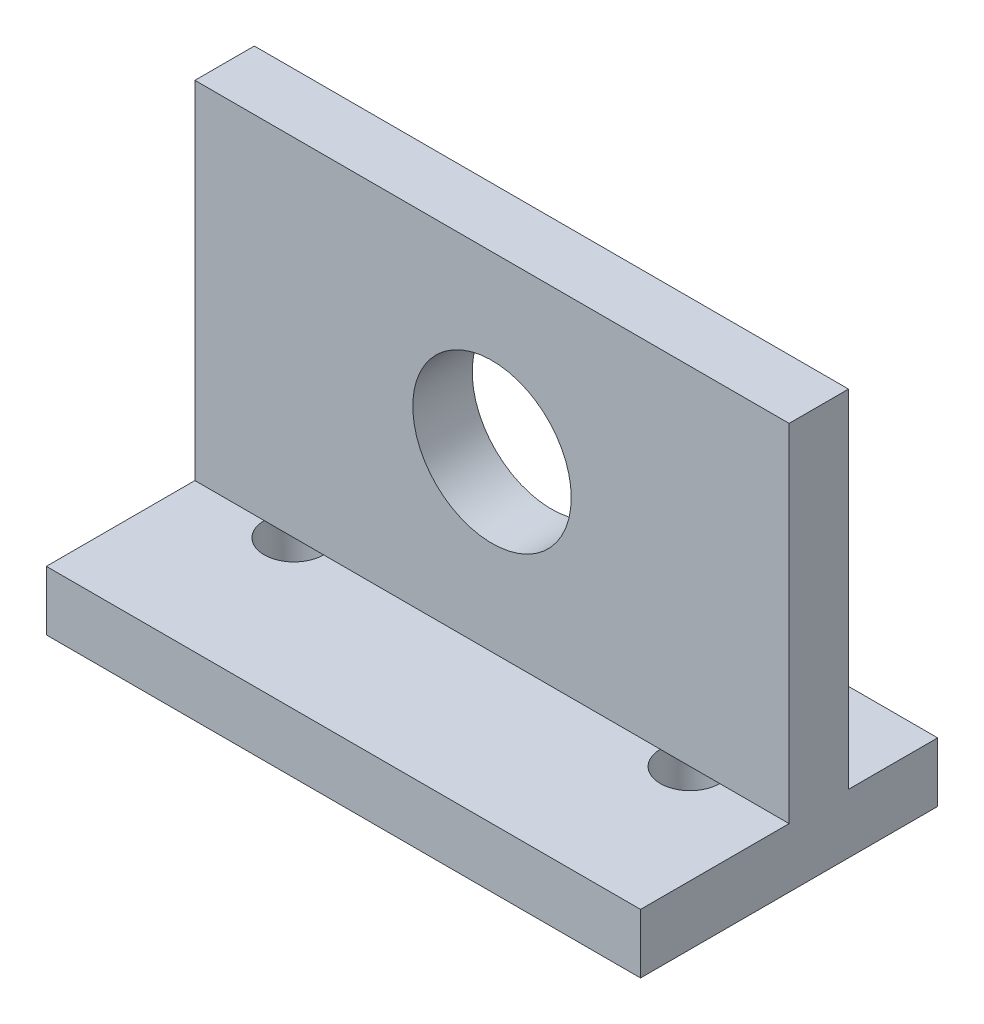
ISO-10303-21;
HEADER;
FILE_DESCRIPTION(('STEP AP214'),'2;1');
FILE_NAME('part.step','',(''),(''),'','','');
FILE_SCHEMA(('AUTOMOTIVE_DESIGN { 1 0 10303 214 1 1 1 1 }'));
ENDSEC;
DATA;
#1=APPLICATION_CONTEXT('core data for automotive mechanical design processes');
#2=APPLICATION_PROTOCOL_DEFINITION('international standard','automotive_design',2000,#1);
#3=PRODUCT_CONTEXT('',#1,'mechanical');
#4=PRODUCT('Part','Part','',(#3));
#5=PRODUCT_RELATED_PRODUCT_CATEGORY('part','',(#4));
#6=PRODUCT_DEFINITION_FORMATION('','',#4);
#7=PRODUCT_DEFINITION_CONTEXT('part definition',#1,'design');
#8=PRODUCT_DEFINITION('design','',#6,#7);
#9=PRODUCT_DEFINITION_SHAPE('','',#8);
#10=(LENGTH_UNIT() NAMED_UNIT(*) SI_UNIT(.MILLI.,.METRE.));
#11=(NAMED_UNIT(*) PLANE_ANGLE_UNIT() SI_UNIT($,.RADIAN.));
#12=(NAMED_UNIT(*) SI_UNIT($,.STERADIAN.) SOLID_ANGLE_UNIT());
#13=UNCERTAINTY_MEASURE_WITH_UNIT(LENGTH_MEASURE(1.E-05),#10,'distance_accuracy_value','');
#14=(GEOMETRIC_REPRESENTATION_CONTEXT(3) GLOBAL_UNCERTAINTY_ASSIGNED_CONTEXT((#13)) GLOBAL_UNIT_ASSIGNED_CONTEXT((#10,
#11,#12)) REPRESENTATION_CONTEXT('',''));
#15=CARTESIAN_POINT('',(0.,0.,0.));
#16=DIRECTION('',(0.,0.,1.));
#17=DIRECTION('',(1.,0.,0.));
#18=AXIS2_PLACEMENT_3D('',#15,#16,#17);
#19=CARTESIAN_POINT('',(0.,0.,0.));
#20=DIRECTION('',(0.,-1.,0.));
#21=DIRECTION('',(0.,0.,-1.));
#22=AXIS2_PLACEMENT_3D('',#19,#20,#21);
#23=PLANE('',#22);
#24=CARTESIAN_POINT('',(-40.,0.,0.));
#25=DIRECTION('',(0.,1.,0.));
#26=DIRECTION('',(0.,0.,1.));
#27=AXIS2_PLACEMENT_3D('',#24,#25,#26);
#28=CIRCLE('',#27,6.);
#29=CARTESIAN_POINT('',(-46.,0.,0.));
#30=VERTEX_POINT('',#29);
#31=CARTESIAN_POINT('',(-34.,0.,0.));
#32=VERTEX_POINT('',#31);
#33=EDGE_CURVE('E119',#30,#32,#28,.T.);
#34=ORIENTED_EDGE('',*,*,#33,.F.);
#35=DIRECTION('',(1.,0.,0.));
#36=VECTOR('',#35,1.);
#37=CARTESIAN_POINT('',(-60.,0.,0.));
#38=LINE('',#37,#36);
#39=CARTESIAN_POINT('',(-60.,0.,0.));
#40=VERTEX_POINT('',#39);
#41=EDGE_CURVE('E132',#40,#30,#38,.T.);
#42=ORIENTED_EDGE('',*,*,#41,.F.);
#43=DIRECTION('',(0.,0.,1.));
#44=VECTOR('',#43,1.);
#45=CARTESIAN_POINT('',(-60.,0.,30.));
#46=LINE('',#45,#44);
#47=CARTESIAN_POINT('',(-60.,0.,30.));
#48=VERTEX_POINT('',#47);
#49=EDGE_CURVE('E229',#40,#48,#46,.T.);
#50=ORIENTED_EDGE('',*,*,#49,.T.);
#51=DIRECTION('',(1.,0.,0.));
#52=VECTOR('',#51,1.);
#53=CARTESIAN_POINT('',(-60.,0.,30.));
#54=LINE('',#53,#52);
#55=CARTESIAN_POINT('',(60.,0.,30.));
#56=VERTEX_POINT('',#55);
#57=EDGE_CURVE('E228',#48,#56,#54,.T.);
#58=ORIENTED_EDGE('',*,*,#57,.T.);
#59=DIRECTION('',(0.,0.,-1.));
#60=VECTOR('',#59,1.);
#61=CARTESIAN_POINT('',(60.,0.,30.));
#62=LINE('',#61,#60);
#63=CARTESIAN_POINT('',(60.,0.,0.));
#64=VERTEX_POINT('',#63);
#65=EDGE_CURVE('E253',#56,#64,#62,.T.);
#66=ORIENTED_EDGE('',*,*,#65,.T.);
#67=CARTESIAN_POINT('',(46.,0.,0.));
#68=VERTEX_POINT('',#67);
#69=EDGE_CURVE('E137',#68,#64,#38,.T.);
#70=ORIENTED_EDGE('',*,*,#69,.F.);
#71=CARTESIAN_POINT('',(40.,0.,0.));
#72=DIRECTION('',(0.,1.,0.));
#73=DIRECTION('',(0.,0.,1.));
#74=AXIS2_PLACEMENT_3D('',#71,#72,#73);
#75=CIRCLE('',#74,5.99999999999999);
#76=CARTESIAN_POINT('',(34.,0.,0.));
#77=VERTEX_POINT('',#76);
#78=EDGE_CURVE('E128',#77,#68,#75,.T.);
#79=ORIENTED_EDGE('',*,*,#78,.F.);
#80=EDGE_CURVE('E62',#32,#77,#38,.T.);
#81=ORIENTED_EDGE('',*,*,#80,.F.);
#82=EDGE_LOOP('',(#34,#42,#50,#58,#66,#70,#79,#81));
#83=FACE_BOUND('',#82,.T.);
#84=ADVANCED_FACE('F39',(#83),#23,.F.);
#85=CARTESIAN_POINT('',(60.,-12.,30.));
#86=DIRECTION('',(1.,0.,0.));
#87=DIRECTION('',(0.,0.,-1.));
#88=AXIS2_PLACEMENT_3D('',#85,#86,#87);
#89=PLANE('',#88);
#90=ORIENTED_EDGE('',*,*,#65,.F.);
#91=DIRECTION('',(0.,1.,0.));
#92=VECTOR('',#91,1.);
#93=CARTESIAN_POINT('',(60.,-12.,30.));
#94=LINE('',#93,#92);
#95=CARTESIAN_POINT('',(60.,-12.,30.));
#96=VERTEX_POINT('',#95);
#97=EDGE_CURVE('E11',#96,#56,#94,.T.);
#98=ORIENTED_EDGE('',*,*,#97,.F.);
#99=DIRECTION('',(0.,0.,-1.));
#100=VECTOR('',#99,1.);
#101=CARTESIAN_POINT('',(60.,-12.,30.));
#102=LINE('',#101,#100);
#103=CARTESIAN_POINT('',(60.,-12.,-30.));
#104=VERTEX_POINT('',#103);
#105=EDGE_CURVE('E226',#96,#104,#102,.T.);
#106=ORIENTED_EDGE('',*,*,#105,.T.);
#107=DIRECTION('',(0.,1.,0.));
#108=VECTOR('',#107,1.);
#109=CARTESIAN_POINT('',(60.,-12.,-30.));
#110=LINE('',#109,#108);
#111=CARTESIAN_POINT('',(60.,0.,-30.));
#112=VERTEX_POINT('',#111);
#113=EDGE_CURVE('E43',#104,#112,#110,.T.);
#114=ORIENTED_EDGE('',*,*,#113,.T.);
#115=CARTESIAN_POINT('',(60.,0.,-12.));
#116=VERTEX_POINT('',#115);
#117=EDGE_CURVE('E251',#116,#112,#62,.T.);
#118=ORIENTED_EDGE('',*,*,#117,.F.);
#119=DIRECTION('',(0.,1.,0.));
#120=VECTOR('',#119,1.);
#121=CARTESIAN_POINT('',(60.,0.,-12.));
#122=LINE('',#121,#120);
#123=CARTESIAN_POINT('',(60.,70.,-12.));
#124=VERTEX_POINT('',#123);
#125=EDGE_CURVE('E140',#116,#124,#122,.T.);
#126=ORIENTED_EDGE('',*,*,#125,.T.);
#127=DIRECTION('',(0.,0.,1.));
#128=VECTOR('',#127,1.);
#129=CARTESIAN_POINT('',(60.,70.,-12.));
#130=LINE('',#129,#128);
#131=CARTESIAN_POINT('',(60.,70.,0.));
#132=VERTEX_POINT('',#131);
#133=EDGE_CURVE('E153',#124,#132,#130,.T.);
#134=ORIENTED_EDGE('',*,*,#133,.T.);
#135=DIRECTION('',(0.,1.,0.));
#136=VECTOR('',#135,1.);
#137=CARTESIAN_POINT('',(60.,0.,0.));
#138=LINE('',#137,#136);
#139=EDGE_CURVE('E144',#64,#132,#138,.T.);
#140=ORIENTED_EDGE('',*,*,#139,.F.);
#141=EDGE_LOOP('',(#90,#98,#106,#114,#118,#126,#134,#140));
#142=FACE_BOUND('',#141,.T.);
#143=ADVANCED_FACE('F41',(#142),#89,.T.);
#144=CARTESIAN_POINT('',(-60.,-12.,30.));
#145=DIRECTION('',(0.,0.,1.));
#146=DIRECTION('',(1.,0.,0.));
#147=AXIS2_PLACEMENT_3D('',#144,#145,#146);
#148=PLANE('',#147);
#149=ORIENTED_EDGE('',*,*,#57,.F.);
#150=DIRECTION('',(0.,1.,0.));
#151=VECTOR('',#150,1.);
#152=CARTESIAN_POINT('',(-60.,-12.,30.));
#153=LINE('',#152,#151);
#154=CARTESIAN_POINT('',(-60.,-12.,30.));
#155=VERTEX_POINT('',#154);
#156=EDGE_CURVE('E48',#155,#48,#153,.T.);
#157=ORIENTED_EDGE('',*,*,#156,.F.);
#158=DIRECTION('',(1.,0.,0.));
#159=VECTOR('',#158,1.);
#160=CARTESIAN_POINT('',(-60.,-12.,30.));
#161=LINE('',#160,#159);
#162=EDGE_CURVE('E238',#155,#96,#161,.T.);
#163=ORIENTED_EDGE('',*,*,#162,.T.);
#164=ORIENTED_EDGE('',*,*,#97,.T.);
#165=EDGE_LOOP('',(#149,#157,#163,#164));
#166=FACE_BOUND('',#165,.T.);
#167=ADVANCED_FACE('F201',(#166),#148,.T.);
#168=CARTESIAN_POINT('',(-60.,-12.,30.));
#169=DIRECTION('',(-1.,0.,0.));
#170=DIRECTION('',(0.,0.,1.));
#171=AXIS2_PLACEMENT_3D('',#168,#169,#170);
#172=PLANE('',#171);
#173=CARTESIAN_POINT('',(-60.,0.,-30.));
#174=VERTEX_POINT('',#173);
#175=CARTESIAN_POINT('',(-60.,0.,-12.));
#176=VERTEX_POINT('',#175);
#177=EDGE_CURVE('E219',#174,#176,#46,.T.);
#178=ORIENTED_EDGE('',*,*,#177,.F.);
#179=DIRECTION('',(0.,1.,0.));
#180=VECTOR('',#179,1.);
#181=CARTESIAN_POINT('',(-60.,-12.,-30.));
#182=LINE('',#181,#180);
#183=CARTESIAN_POINT('',(-60.,-12.,-30.));
#184=VERTEX_POINT('',#183);
#185=EDGE_CURVE('E237',#184,#174,#182,.T.);
#186=ORIENTED_EDGE('',*,*,#185,.F.);
#187=DIRECTION('',(0.,0.,1.));
#188=VECTOR('',#187,1.);
#189=CARTESIAN_POINT('',(-60.,-12.,30.));
#190=LINE('',#189,#188);
#191=EDGE_CURVE('E242',#184,#155,#190,.T.);
#192=ORIENTED_EDGE('',*,*,#191,.T.);
#193=ORIENTED_EDGE('',*,*,#156,.T.);
#194=ORIENTED_EDGE('',*,*,#49,.F.);
#195=DIRECTION('',(0.,-1.,0.));
#196=VECTOR('',#195,1.);
#197=CARTESIAN_POINT('',(-60.,0.,0.));
#198=LINE('',#197,#196);
#199=CARTESIAN_POINT('',(-60.,70.,0.));
#200=VERTEX_POINT('',#199);
#201=EDGE_CURVE('E136',#200,#40,#198,.T.);
#202=ORIENTED_EDGE('',*,*,#201,.F.);
#203=DIRECTION('',(0.,0.,1.));
#204=VECTOR('',#203,1.);
#205=CARTESIAN_POINT('',(-60.,70.,-12.));
#206=LINE('',#205,#204);
#207=CARTESIAN_POINT('',(-60.,70.,-12.));
#208=VERTEX_POINT('',#207);
#209=EDGE_CURVE('E254',#208,#200,#206,.T.);
#210=ORIENTED_EDGE('',*,*,#209,.F.);
#211=DIRECTION('',(0.,-1.,0.));
#212=VECTOR('',#211,1.);
#213=CARTESIAN_POINT('',(-60.,0.,-12.));
#214=LINE('',#213,#212);
#215=EDGE_CURVE('E152',#208,#176,#214,.T.);
#216=ORIENTED_EDGE('',*,*,#215,.T.);
#217=EDGE_LOOP('',(#178,#186,#192,#193,#194,#202,#210,#216));
#218=FACE_BOUND('',#217,.T.);
#219=ADVANCED_FACE('F264',(#218),#172,.T.);
#220=CARTESIAN_POINT('',(-60.,-12.,-30.));
#221=DIRECTION('',(0.,0.,-1.));
#222=DIRECTION('',(-1.,0.,0.));
#223=AXIS2_PLACEMENT_3D('',#220,#221,#222);
#224=PLANE('',#223);
#225=DIRECTION('',(-1.,0.,0.));
#226=VECTOR('',#225,1.);
#227=CARTESIAN_POINT('',(-60.,0.,-30.));
#228=LINE('',#227,#226);
#229=EDGE_CURVE('E221',#112,#174,#228,.T.);
#230=ORIENTED_EDGE('',*,*,#229,.F.);
#231=ORIENTED_EDGE('',*,*,#113,.F.);
#232=DIRECTION('',(-1.,0.,0.));
#233=VECTOR('',#232,1.);
#234=CARTESIAN_POINT('',(-60.,-12.,-30.));
#235=LINE('',#234,#233);
#236=EDGE_CURVE('E248',#104,#184,#235,.T.);
#237=ORIENTED_EDGE('',*,*,#236,.T.);
#238=ORIENTED_EDGE('',*,*,#185,.T.);
#239=EDGE_LOOP('',(#230,#231,#237,#238));
#240=FACE_BOUND('',#239,.T.);
#241=ADVANCED_FACE('F214',(#240),#224,.T.);
#242=CARTESIAN_POINT('',(0.,-12.,0.));
#243=DIRECTION('',(0.,-1.,0.));
#244=DIRECTION('',(0.,0.,-1.));
#245=AXIS2_PLACEMENT_3D('',#242,#243,#244);
#246=PLANE('',#245);
#247=CARTESIAN_POINT('',(-40.,-12.,0.));
#248=DIRECTION('',(0.,1.,0.));
#249=DIRECTION('',(0.,0.,1.));
#250=AXIS2_PLACEMENT_3D('',#247,#248,#249);
#251=CIRCLE('',#250,6.);
#252=CARTESIAN_POINT('',(-40.,-12.,6.));
#253=VERTEX_POINT('',#252);
#254=EDGE_CURVE('E130',#253,#253,#251,.T.);
#255=ORIENTED_EDGE('',*,*,#254,.T.);
#256=EDGE_LOOP('',(#255));
#257=FACE_BOUND('',#256,.T.);
#258=CARTESIAN_POINT('',(40.,-12.,0.));
#259=DIRECTION('',(0.,1.,0.));
#260=DIRECTION('',(0.,0.,1.));
#261=AXIS2_PLACEMENT_3D('',#258,#259,#260);
#262=CIRCLE('',#261,5.99999999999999);
#263=CARTESIAN_POINT('',(40.,-12.,5.99999999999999));
#264=VERTEX_POINT('',#263);
#265=EDGE_CURVE('E149',#264,#264,#262,.T.);
#266=ORIENTED_EDGE('',*,*,#265,.T.);
#267=EDGE_LOOP('',(#266));
#268=FACE_BOUND('',#267,.T.);
#269=ORIENTED_EDGE('',*,*,#105,.F.);
#270=ORIENTED_EDGE('',*,*,#162,.F.);
#271=ORIENTED_EDGE('',*,*,#191,.F.);
#272=ORIENTED_EDGE('',*,*,#236,.F.);
#273=EDGE_LOOP('',(#269,#270,#271,#272));
#274=FACE_BOUND('',#273,.T.);
#275=ADVANCED_FACE('F208',(#257,#268,#274),#246,.T.);
#276=ORIENTED_EDGE('',*,*,#177,.T.);
#277=DIRECTION('',(1.,0.,0.));
#278=VECTOR('',#277,1.);
#279=CARTESIAN_POINT('',(-60.,0.,-12.));
#280=LINE('',#279,#278);
#281=EDGE_CURVE('E147',#176,#116,#280,.T.);
#282=ORIENTED_EDGE('',*,*,#281,.T.);
#283=ORIENTED_EDGE('',*,*,#117,.T.);
#284=ORIENTED_EDGE('',*,*,#229,.T.);
#285=EDGE_LOOP('',(#276,#282,#283,#284));
#286=FACE_BOUND('',#285,.T.);
#287=ADVANCED_FACE('F197',(#286),#23,.F.);
#288=CARTESIAN_POINT('',(-60.,70.,-12.));
#289=DIRECTION('',(0.,1.,0.));
#290=DIRECTION('',(0.,0.,1.));
#291=AXIS2_PLACEMENT_3D('',#288,#289,#290);
#292=PLANE('',#291);
#293=DIRECTION('',(-1.,0.,0.));
#294=VECTOR('',#293,1.);
#295=CARTESIAN_POINT('',(-60.,70.,0.));
#296=LINE('',#295,#294);
#297=EDGE_CURVE('E142',#132,#200,#296,.T.);
#298=ORIENTED_EDGE('',*,*,#297,.F.);
#299=ORIENTED_EDGE('',*,*,#133,.F.);
#300=DIRECTION('',(-1.,0.,0.));
#301=VECTOR('',#300,1.);
#302=CARTESIAN_POINT('',(-60.,70.,-12.));
#303=LINE('',#302,#301);
#304=EDGE_CURVE('E156',#124,#208,#303,.T.);
#305=ORIENTED_EDGE('',*,*,#304,.T.);
#306=ORIENTED_EDGE('',*,*,#209,.T.);
#307=EDGE_LOOP('',(#298,#299,#305,#306));
#308=FACE_BOUND('',#307,.T.);
#309=ADVANCED_FACE('F195',(#308),#292,.T.);
#310=CARTESIAN_POINT('',(0.,0.,-12.));
#311=DIRECTION('',(0.,0.,-1.));
#312=DIRECTION('',(-1.,0.,0.));
#313=AXIS2_PLACEMENT_3D('',#310,#311,#312);
#314=PLANE('',#313);
#315=CARTESIAN_POINT('',(0.,35.,-12.));
#316=DIRECTION('',(0.,0.,1.));
#317=DIRECTION('',(1.,0.,0.));
#318=AXIS2_PLACEMENT_3D('',#315,#316,#317);
#319=CIRCLE('',#318,16.);
#320=CARTESIAN_POINT('',(16.,35.,-12.));
#321=VERTEX_POINT('',#320);
#322=EDGE_CURVE('E125',#321,#321,#319,.T.);
#323=ORIENTED_EDGE('',*,*,#322,.T.);
#324=EDGE_LOOP('',(#323));
#325=FACE_BOUND('',#324,.T.);
#326=ORIENTED_EDGE('',*,*,#125,.F.);
#327=ORIENTED_EDGE('',*,*,#281,.F.);
#328=ORIENTED_EDGE('',*,*,#215,.F.);
#329=ORIENTED_EDGE('',*,*,#304,.F.);
#330=EDGE_LOOP('',(#326,#327,#328,#329));
#331=FACE_BOUND('',#330,.T.);
#332=ADVANCED_FACE('F172',(#325,#331),#314,.T.);
#333=CARTESIAN_POINT('',(0.,0.,0.));
#334=DIRECTION('',(0.,0.,-1.));
#335=DIRECTION('',(-1.,0.,0.));
#336=AXIS2_PLACEMENT_3D('',#333,#334,#335);
#337=PLANE('',#336);
#338=CARTESIAN_POINT('',(0.,35.,0.));
#339=DIRECTION('',(0.,0.,1.));
#340=DIRECTION('',(1.,0.,0.));
#341=AXIS2_PLACEMENT_3D('',#338,#339,#340);
#342=CIRCLE('',#341,16.);
#343=CARTESIAN_POINT('',(16.,35.,0.));
#344=VERTEX_POINT('',#343);
#345=EDGE_CURVE('E170',#344,#344,#342,.T.);
#346=ORIENTED_EDGE('',*,*,#345,.F.);
#347=EDGE_LOOP('',(#346));
#348=FACE_BOUND('',#347,.T.);
#349=ORIENTED_EDGE('',*,*,#139,.T.);
#350=ORIENTED_EDGE('',*,*,#297,.T.);
#351=ORIENTED_EDGE('',*,*,#201,.T.);
#352=ORIENTED_EDGE('',*,*,#41,.T.);
#353=EDGE_CURVE('E127',#30,#32,#38,.T.);
#354=ORIENTED_EDGE('',*,*,#353,.T.);
#355=ORIENTED_EDGE('',*,*,#80,.T.);
#356=EDGE_CURVE('E133',#77,#68,#38,.T.);
#357=ORIENTED_EDGE('',*,*,#356,.T.);
#358=ORIENTED_EDGE('',*,*,#69,.T.);
#359=EDGE_LOOP('',(#349,#350,#351,#352,#354,#355,#357,#358));
#360=FACE_BOUND('',#359,.T.);
#361=ADVANCED_FACE('F131',(#348,#360),#337,.F.);
#362=CARTESIAN_POINT('',(40.,0.,0.));
#363=DIRECTION('',(0.,1.,0.));
#364=DIRECTION('',(0.,0.,1.));
#365=AXIS2_PLACEMENT_3D('',#362,#363,#364);
#366=PLANE('',#365);
#367=EDGE_CURVE('E161',#68,#77,#75,.T.);
#368=ORIENTED_EDGE('',*,*,#367,.F.);
#369=ORIENTED_EDGE('',*,*,#356,.F.);
#370=EDGE_LOOP('',(#368,#369));
#371=FACE_BOUND('',#370,.T.);
#372=ADVANCED_FACE('F181',(#371),#366,.F.);
#373=CARTESIAN_POINT('',(40.,-12.,0.));
#374=DIRECTION('',(0.,1.,0.));
#375=DIRECTION('',(0.,0.,1.));
#376=AXIS2_PLACEMENT_3D('',#373,#374,#375);
#377=CYLINDRICAL_SURFACE('',#376,5.99999999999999);
#378=ORIENTED_EDGE('',*,*,#265,.F.);
#379=EDGE_LOOP('',(#378));
#380=FACE_BOUND('',#379,.T.);
#381=ORIENTED_EDGE('',*,*,#367,.T.);
#382=ORIENTED_EDGE('',*,*,#78,.T.);
#383=EDGE_LOOP('',(#381,#382));
#384=FACE_BOUND('',#383,.T.);
#385=ADVANCED_FACE('F190',(#380,#384),#377,.F.);
#386=CARTESIAN_POINT('',(-40.,0.,0.));
#387=DIRECTION('',(0.,1.,0.));
#388=DIRECTION('',(0.,0.,1.));
#389=AXIS2_PLACEMENT_3D('',#386,#387,#388);
#390=PLANE('',#389);
#391=EDGE_CURVE('E54',#32,#30,#28,.T.);
#392=ORIENTED_EDGE('',*,*,#391,.F.);
#393=ORIENTED_EDGE('',*,*,#353,.F.);
#394=EDGE_LOOP('',(#392,#393));
#395=FACE_BOUND('',#394,.T.);
#396=ADVANCED_FACE('F121',(#395),#390,.F.);
#397=CARTESIAN_POINT('',(-40.,-12.,0.));
#398=DIRECTION('',(0.,1.,0.));
#399=DIRECTION('',(0.,0.,1.));
#400=AXIS2_PLACEMENT_3D('',#397,#398,#399);
#401=CYLINDRICAL_SURFACE('',#400,6.);
#402=ORIENTED_EDGE('',*,*,#254,.F.);
#403=EDGE_LOOP('',(#402));
#404=FACE_BOUND('',#403,.T.);
#405=ORIENTED_EDGE('',*,*,#391,.T.);
#406=ORIENTED_EDGE('',*,*,#33,.T.);
#407=EDGE_LOOP('',(#405,#406));
#408=FACE_BOUND('',#407,.T.);
#409=ADVANCED_FACE('F117',(#404,#408),#401,.F.);
#410=CARTESIAN_POINT('',(0.,35.,-12.));
#411=DIRECTION('',(0.,0.,1.));
#412=DIRECTION('',(1.,0.,0.));
#413=AXIS2_PLACEMENT_3D('',#410,#411,#412);
#414=CYLINDRICAL_SURFACE('',#413,16.);
#415=ORIENTED_EDGE('',*,*,#322,.F.);
#416=EDGE_LOOP('',(#415));
#417=FACE_BOUND('',#416,.T.);
#418=ORIENTED_EDGE('',*,*,#345,.T.);
#419=EDGE_LOOP('',(#418));
#420=FACE_BOUND('',#419,.T.);
#421=ADVANCED_FACE('F177',(#417,#420),#414,.F.);
#422=CLOSED_SHELL('',(#84,#143,#167,#219,#241,#275,#287,#309,#332,#361,#372,#385,#396,#409,#421));
#423=MANIFOLD_SOLID_BREP('B2',#422);
#424=ADVANCED_BREP_SHAPE_REPRESENTATION('',(#18,#423),#14);
#425=SHAPE_DEFINITION_REPRESENTATION(#9,#424);
ENDSEC;
END-ISO-10303-21;
